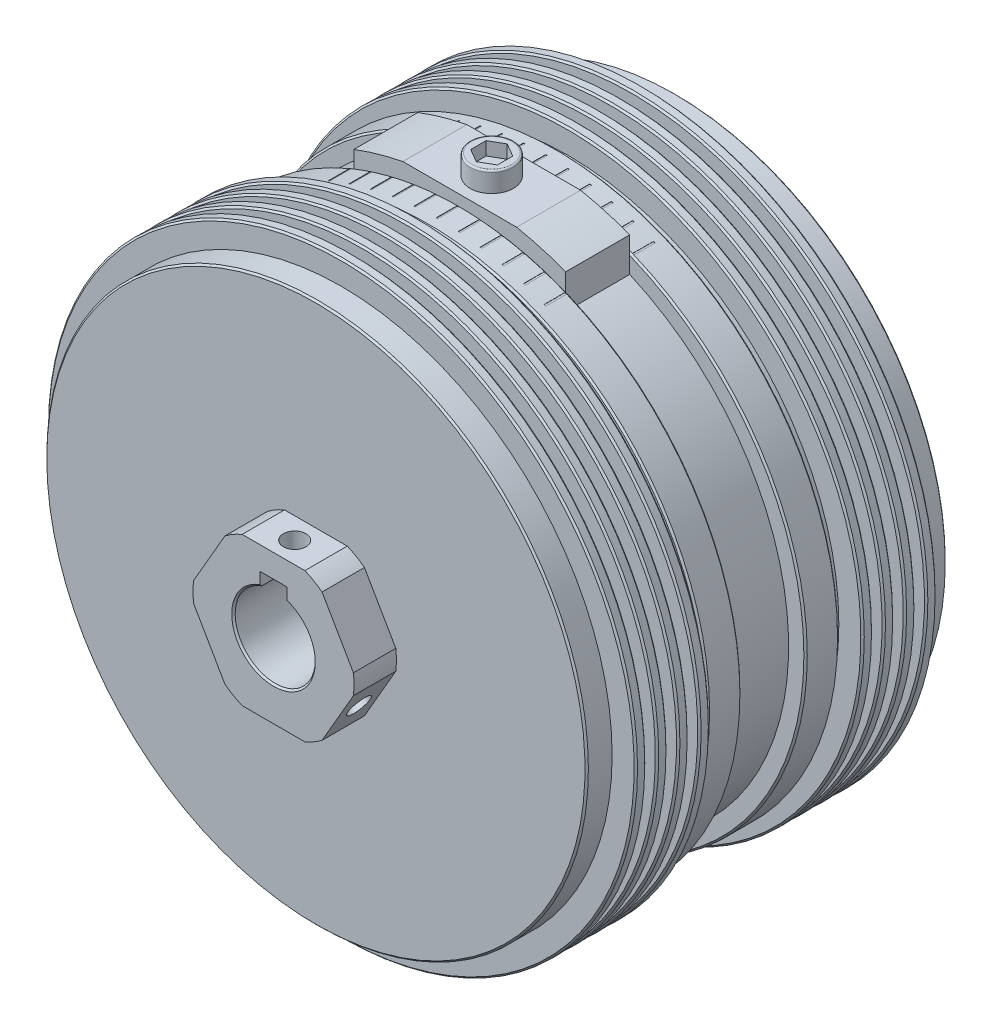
from build123d import *

# Parameters (mm, degrees)
CHAMFER1_SIZE               = 0.508
BOSS_EXTRUDE1_START         = 19.177
BOSS_EXTRUDE1_DEPTH         = 19.177
SKETCH5_R                   = 6.5024
BOSS_EXTRUDE2_DEPTH         = 5.9944
CUT_EXTRUDE3_DEPTH          = 3.9878
FILLET2_R                   = 0.508
CIRPATTERN2_COUNT           = 2
FILLET2_OF_CIRPATTERN2_R    = 0.508
CHAMFER3_SIZE               = 0.508
SKETCH19_W                  = 0.508
SKETCH19_H                  = 6.35
SKETCH19_H_2                = 6.3
CUT_EXTRUDE10_DEPTH         = 0.1016
CIRPATTERN8_COUNT           = 6
CIRPATTERN8_ANGLE           = 22.5
CIRPATTERN9_COUNT           = 6
CIRPATTERN9_ANGLE           = 22.5
CIRPATTERN10_COUNT          = 3
SKETCH22_OUTSIDE_W          = 236.47
SKETCH22_OUTSIDE_H          = 246.432
CUT_EXTRUDE11_DEPTH         = 12.7
CUT_EXTRUDE12_DEPTH         = 186.665264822
M8X1_25_TAPPED_HOLE2_REACH  = 203.086
M8X1_25_TAPPED_HOLE2_BORE_R = 3.4
CIRPATTERN11_COUNT          = 2
CIRPATTERN11_ANGLE          = 120
CUT_EXTRUDE13_DEPTH         = 10.414


with BuildPart() as part:
    # Sketch1 → Revolve1 (revolve)
    with BuildSketch(Plane(origin=(0, 0, 0), x_dir=(0, 0, -1), z_dir=(1, 0, 0)), mode=Mode.PRIVATE) as revolve1_sk:
        with BuildLine():
            Line((0, 24.13), (12.7, 24.13))
            Line((12.7, 24.13), (12.7, 81.153))
            Line((12.7, 81.153), (20.32, 81.153))
            Line((20.32, 81.153), (20.32, 88.265))
            Line((20.32, 88.265), (23.495, 88.265))
            Line((23.495, 88.265), (23.495, 81.153))
            Line((23.495, 81.153), (26.67, 81.153))
            Line((26.67, 81.153), (26.67, 88.265))
            Line((26.67, 88.265), (29.845, 88.265))
            Line((29.845, 88.265), (29.845, 81.153))
            Line((29.845, 81.153), (33.02, 81.153))
            Line((33.02, 81.153), (33.02, 88.265))
            Line((33.02, 88.265), (36.195, 88.265))
            Line((36.195, 88.265), (36.195, 81.153))
            Line((36.195, 81.153), (39.37, 81.153))
            Line((39.37, 81.153), (39.37, 88.265))
            Line((39.37, 88.265), (42.545, 88.265))
            Line((42.545, 88.265), (42.545, 81.153))
            Line((42.545, 81.153), (45.72, 81.153))
            Line((45.72, 81.153), (45.72, 84.455))
            Line((45.72, 84.455), (55.8165, 84.455))
            Line((55.8165, 84.455), (55.8165, 79.375))
            Line((55.8165, 79.375), (74.9935, 79.375))
            Line((74.9935, 79.375), (74.9935, 84.455))
            Line((74.9935, 84.455), (85.09, 84.455))
            Line((85.09, 84.455), (85.09, 81.153))
            Line((85.09, 81.153), (88.265, 81.153))
            Line((88.265, 81.153), (88.265, 88.265))
            Line((88.265, 88.265), (91.44, 88.265))
            Line((91.44, 88.265), (91.44, 81.153))
            Line((91.44, 81.153), (94.615, 81.153))
            Line((94.615, 81.153), (94.615, 88.265))
            Line((94.615, 88.265), (97.79, 88.265))
            Line((97.79, 88.265), (97.79, 81.153))
            Line((97.79, 81.153), (100.965, 81.153))
            Line((100.965, 81.153), (100.965, 88.265))
            Line((100.965, 88.265), (104.14, 88.265))
            Line((104.14, 88.265), (104.14, 81.153))
            Line((104.14, 81.153), (107.315, 81.153))
            Line((107.315, 81.153), (107.315, 88.265))
            Line((107.315, 88.265), (110.49, 88.265))
            Line((110.49, 88.265), (110.49, 81.153))
            Line((110.49, 81.153), (120.65, 81.153))
            Line((120.65, 81.153), (120.65, 41.656))
            ThreePointArc((120.65, 41.656), (120.761592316, 41.386592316), (121.031, 41.275))
            Line((121.031, 41.275), (123.698, 41.275))
            Line((123.698, 41.275), (123.698, 28.956))
            Line((123.698, 28.956), (131.2418, 28.956))
            Line((131.2418, 28.956), (131.2418, 19.812))
            Line((131.2418, 19.812), (134.112, 19.812))
            Line((134.112, 19.812), (134.112, 12.00023))
            Line((134.112, 12.00023), (0, 12.00023))
            Line((0, 12.00023), (0, 24.13))
        make_face()
    revolve(revolve1_sk.sketch.rotate(Axis((0, 0, 0), (0, 0, -1)), 90), axis=Axis((0, 0, 0), (0, 0, -1)))

    # Chamfer1
    chamfer1_edges = [part.edges().sort_by_distance(p)[0] for p in [
        (-88.265, 0, -107.315),
        (-88.265, 0, -104.14),
        (-88.265, 0, -100.965),
        (-88.265, 0, -97.79),
        (-88.265, 0, -94.615),
        (-88.265, 0, -91.44),
        (-88.265, 0, -88.265),
        (-84.455, 0, -85.09),
        (-84.455, 0, -74.9935),
        (-84.455, 0, -55.8165),
        (-84.455, 0, -45.72),
        (-88.265, 0, -42.545),
        (-88.265, 0, -39.37),
        (-88.265, 0, -36.195),
        (-88.265, 0, -33.02),
        (-88.265, 0, -29.845),
        (-88.265, 0, -26.67),
        (-88.265, 0, -23.495),
        (-88.265, 0, -20.32),
        (-12.00023, 0, 0),
        (-12.00023, 0, -134.112),
        (-41.275, 0, -123.698),
        (-88.265, 0, -110.49),
    ]]
    chamfer(chamfer1_edges, length=CHAMFER1_SIZE)

    # Sketch4 → Boss-Extrude1 (add)
    with BuildSketch(Plane(origin=(0, 0, -55.8165), x_dir=(-1, 0, 0), z_dir=(0, 0, -1)).offset(BOSS_EXTRUDE1_START)):
        with BuildLine():
            ThreePointArc((-31.75, 72.748389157), (0, 79.375), (31.75, 72.748389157))
            Line((31.75, 72.748389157), (31.75, 83.037024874))
            ThreePointArc((31.75, 83.037024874), (24.485470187, 85.461522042), (17.039227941, 87.251789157))
            Line((17.039227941, 87.251789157), (0, 87.251789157))
            Line((0, 87.251789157), (-17.039227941, 87.251789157))
            ThreePointArc((-17.039227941, 87.251789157), (-24.485470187, 85.461522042), (-31.75, 83.037024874))
            Line((-31.75, 83.037024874), (-31.75, 72.748389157))
        make_face()
    boss_extrude1 = extrude(amount=-BOSS_EXTRUDE1_DEPTH)

    # Sketch5 → Boss-Extrude2 (add)
    with BuildSketch(Plane(origin=(0, 87.251789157, 0), x_dir=(1, 0, 0), z_dir=(0, 1, 0))):
        with Locations(Location((0, 65.405, 0), (0, 0, 90))):
            Circle(SKETCH5_R)
    boss_extrude2 = extrude(amount=BOSS_EXTRUDE2_DEPTH)

    # Sketch6 → Cut-Extrude3 (cut)
    with BuildSketch(Plane(origin=(0, 93.246189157, 0), x_dir=(-1, 0, 0), z_dir=(0, 1, 0))):
        Polygon((-4.0005, -63.095310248), (-4.0005, -67.714689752), (0, -70.024379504), (4.0005, -67.714689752), (4.0005, -63.095310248), (0, -60.785620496), align=None)
    cut_extrude3 = extrude(amount=-CUT_EXTRUDE3_DEPTH, mode=Mode.SUBTRACT)

    # Fillet2
    fillet2_edges = [part.edges().sort_by_distance(p)[0] for p in [
        (0, 93.246189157, -58.9026),
    ]]
    fillet(fillet2_edges, radius=FILLET2_R)

    # CirPattern2: Boss-Extrude1, Boss-Extrude2, Cut-Extrude3 ×2 about axis
    cirpattern2_axis = Axis((0, 0, 0), (0, 0, 1))
    add([boss_extrude1.rotate(cirpattern2_axis, i * 360 / CIRPATTERN2_COUNT) for i in range(1, CIRPATTERN2_COUNT)])
    add([boss_extrude2.rotate(cirpattern2_axis, i * 360 / CIRPATTERN2_COUNT) for i in range(1, CIRPATTERN2_COUNT)])
    add([cut_extrude3.rotate(cirpattern2_axis, i * 360 / CIRPATTERN2_COUNT) for i in range(1, CIRPATTERN2_COUNT)], mode=Mode.SUBTRACT)

    # Fillet2 of CirPattern2
    fillet2_of_cirpattern2_edges = [part.edges().sort_by_distance(p)[0] for p in [
        (0, -93.246189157, -58.9026),
    ]]
    fillet(fillet2_of_cirpattern2_edges, radius=FILLET2_OF_CIRPATTERN2_R)

    # Chamfer3
    chamfer3_edges = [part.edges().sort_by_distance(p)[0] for p in [
        (-81.153, 0, -12.7),
        (-81.153, 0, -120.65),
    ]]
    chamfer(chamfer3_edges, length=CHAMFER3_SIZE)

    # Sketch19 → Cut-Extrude10 (cut)
    with BuildSketch(Plane(origin=(0, 84.455, 0), x_dir=(-1, 0, 0), z_dir=(0, 1, 0))):
        with Locations((0, -52.1335)):
            Rectangle(SKETCH19_W, SKETCH19_H)
        with Locations((0, -78.6515)):
            Rectangle(SKETCH19_W, SKETCH19_H_2)
    cut_extrude10 = extrude(amount=-CUT_EXTRUDE10_DEPTH, mode=Mode.SUBTRACT)

    # CirPattern8: Cut-Extrude10 ×6 about axis
    cirpattern8_axis = Axis((0, 0, 0), (0, 0, 1))
    for i in range(1, CIRPATTERN8_COUNT):
        add(cut_extrude10.rotate(cirpattern8_axis, i * CIRPATTERN8_ANGLE / (CIRPATTERN8_COUNT - 1)), mode=Mode.SUBTRACT)

    # CirPattern9: Cut-Extrude10 ×6 about axis
    cirpattern9_axis = Axis((0, 0, 0), (0, 0, -1))
    for i in range(1, CIRPATTERN9_COUNT):
        add(cut_extrude10.rotate(cirpattern9_axis, i * CIRPATTERN9_ANGLE / (CIRPATTERN9_COUNT - 1)), mode=Mode.SUBTRACT)

    # Sketch20 → M8x1.25 Tapped Hole1 (revolve, cut)
    with BuildSketch(Plane(origin=(0, 50.8, -120.65), x_dir=(0, 1, 0), z_dir=(1, 0, 0))):
        Polygon((0, 0), (0, 18.806926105), (3.4, 16.764), (3.4, 0), align=None)
    m8x1_25_tapped_hole1 = revolve(axis=Axis((0, 50.8, -127), (0, 0, 1)), mode=Mode.SUBTRACT)

    # CirPattern10: M8x1.25 Tapped Hole1 ×3 about axis
    cirpattern10_axis = Axis((0, 0, 0), (0, 0, 1))
    for i in range(1, CIRPATTERN10_COUNT):
        add(m8x1_25_tapped_hole1.rotate(cirpattern10_axis, i * 360 / CIRPATTERN10_COUNT), mode=Mode.SUBTRACT)

    # Sketch22 outside → Cut-Extrude11 (cut)
    with BuildSketch(Plane.XY):
        Rectangle(SKETCH22_OUTSIDE_W, SKETCH22_OUTSIDE_H)
        Polygon((-12.831609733, 22.225), (-25.663219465, 0), (-12.831609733, -22.225), (12.831609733, -22.225), (25.663219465, 0), (12.831609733, 22.225), align=None, mode=Mode.SUBTRACT)
    extrude(amount=-CUT_EXTRUDE11_DEPTH, mode=Mode.SUBTRACT)

    # Sketch23 → Cut-Extrude12 (cut, through all)
    with BuildSketch(Plane.XY):
        Polygon((0, 7.30377), (4.0005, 7.30377), (4.0005, 15.30477), (-4.0005, 15.30477), (-4.0005, 7.30377), align=None)
    extrude(amount=-CUT_EXTRUDE12_DEPTH, mode=Mode.SUBTRACT)

    # M8x1.25 Tapped Hole2 bore → M8x1.25 Tapped Hole2 (cut, up to next)
    with BuildSketch(Plane(origin=(19.247414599, -11.1125, 0), x_dir=(0, 0, -1), z_dir=(0.8660254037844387, -0.4999999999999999, 0)), mode=Mode.PRIVATE) as m8x1_25_tapped_hole2_sk1:
        with Locations((6.35, 0)):
            Circle(M8X1_25_TAPPED_HOLE2_BORE_R)
    m8x1_25_tapped_hole2_tool1 = extrude(m8x1_25_tapped_hole2_sk1.sketch, amount=-M8X1_25_TAPPED_HOLE2_REACH, mode=Mode.PRIVATE) & part.part
    m8x1_25_tapped_hole2 = m8x1_25_tapped_hole2_tool1.solids().sort_by_distance((19.247415, -11.1125, -6.35))[0]
    add(m8x1_25_tapped_hole2, mode=Mode.SUBTRACT)

    # CirPattern11: M8x1.25 Tapped Hole2 ×2 about axis
    cirpattern11_axis = Axis((0, 0, 0), (0, 0, 1))
    for i in range(1, CIRPATTERN11_COUNT):
        add(m8x1_25_tapped_hole2.rotate(cirpattern11_axis, i * CIRPATTERN11_ANGLE / (CIRPATTERN11_COUNT - 1)), mode=Mode.SUBTRACT)

    # Sketch26 → Cut-Extrude13 (cut)
    with BuildSketch(Plane(origin=(0, 0, -134.112), x_dir=(-1, 0, 0), z_dir=(0, 0, -1))):
        with BuildLine():
            Line((3.175, -28.781405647), (3.175, -26.3144))
            Line((3.175, -26.3144), (-3.175, -26.3144))
            Line((-3.175, -26.3144), (-3.175, -28.781405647))
            ThreePointArc((-3.175, -28.781405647), (0, -28.956), (3.175, -28.781405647))
        make_face()
        with BuildLine():
            Line((-28.781405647, -3.175), (-26.3144, -3.175))
            Line((-26.3144, -3.175), (-26.3144, 3.175))
            Line((-26.3144, 3.175), (-28.781405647, 3.175))
            ThreePointArc((-28.781405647, 3.175), (-28.956, 0), (-28.781405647, -3.175))
        make_face()
        with BuildLine():
            Line((-3.175, 26.3144), (3.175, 26.3144))
            Line((3.175, 26.3144), (3.175, 28.781405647))
            ThreePointArc((3.175, 28.781405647), (0, 28.956), (-3.175, 28.781405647))
            Line((-3.175, 28.781405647), (-3.175, 26.3144))
        make_face()
        with BuildLine():
            Line((26.3144, -3.175), (26.3144, 3.175))
            Line((26.3144, 3.175), (28.781405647, 3.175))
            ThreePointArc((28.781405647, 3.175), (28.956, 0), (28.781405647, -3.175))
            Line((28.781405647, -3.175), (26.3144, -3.175))
        make_face()
    extrude(amount=-CUT_EXTRUDE13_DEPTH, mode=Mode.SUBTRACT)


solid = part.part
